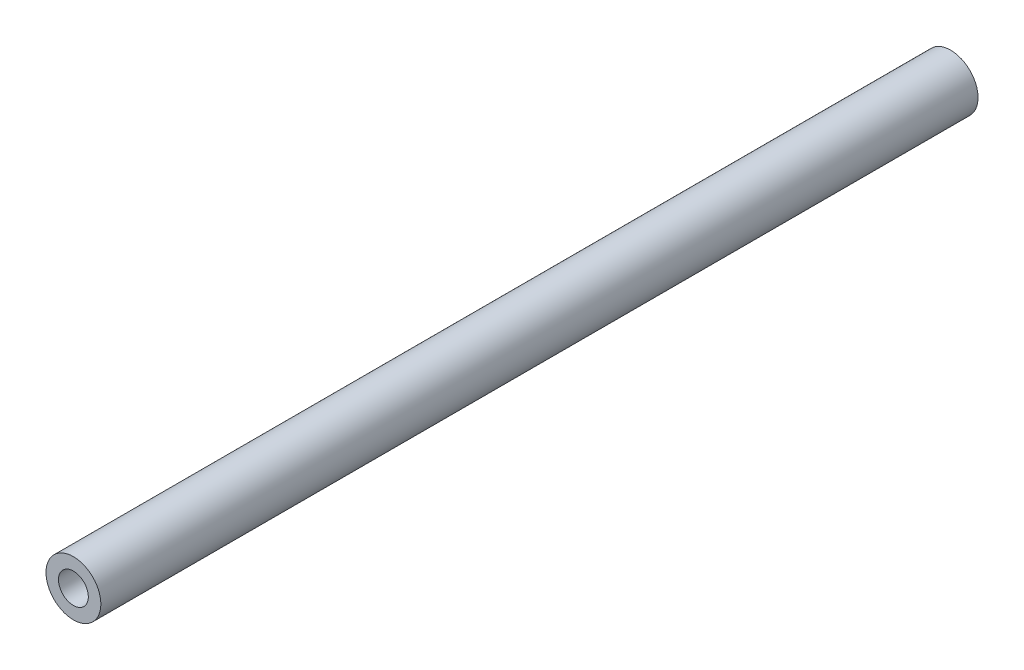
from build123d import *

# Parameters (mm, degrees)
SKETCH1_R                 = 3.175
SKETCH1_R_2               = 1.524
EXTRUDE1_DEPTH            = 101.6
F_8_32_TAPPED_HOLE1_D     = 3.4544
F_8_32_TAPPED_HOLE1_DEPTH = 12.446
F_8_32_TAPPED_HOLE1_TIP   = 1.037806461
F_8_32_TAPPED_HOLE2_D     = 3.4544
F_8_32_TAPPED_HOLE2_DEPTH = 12.446
F_8_32_TAPPED_HOLE2_TIP   = 1.037806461


with BuildPart() as part:
    # Sketch1 → Extrude1 (new body)
    with BuildSketch(Plane.XY):
        Circle(SKETCH1_R)
        Circle(SKETCH1_R_2, mode=Mode.SUBTRACT)
    extrude(amount=EXTRUDE1_DEPTH)

    # 8-32 Tapped Hole1
    with Locations(Plane(origin=(0, 0, 0), x_dir=(-1, 0, 0), z_dir=(0, 0, -1))):
        with Locations((0, 0)):
            Hole(F_8_32_TAPPED_HOLE1_D / 2, depth=F_8_32_TAPPED_HOLE1_DEPTH)
            with Locations((0, 0, -(F_8_32_TAPPED_HOLE1_DEPTH + F_8_32_TAPPED_HOLE1_TIP / 2))):  # 118° drill point
                Cone(0, F_8_32_TAPPED_HOLE1_D / 2, F_8_32_TAPPED_HOLE1_TIP, mode=Mode.SUBTRACT)

    # 8-32 Tapped Hole2
    with Locations(Plane.XY.offset(101.6)):
        with Locations((0, 0)):
            Hole(F_8_32_TAPPED_HOLE2_D / 2, depth=F_8_32_TAPPED_HOLE2_DEPTH)
            with Locations((0, 0, -(F_8_32_TAPPED_HOLE2_DEPTH + F_8_32_TAPPED_HOLE2_TIP / 2))):  # 118° drill point
                Cone(0, F_8_32_TAPPED_HOLE2_D / 2, F_8_32_TAPPED_HOLE2_TIP, mode=Mode.SUBTRACT)


solid = part.part
